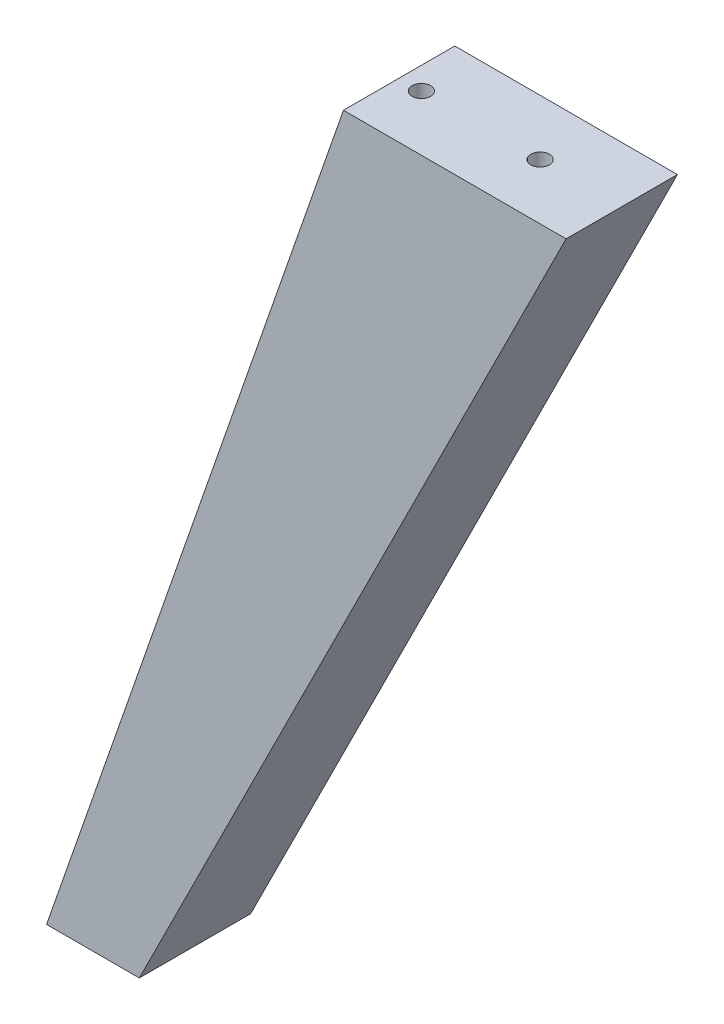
ISO-10303-21;
HEADER;
FILE_DESCRIPTION(('STEP AP214'),'2;1');
FILE_NAME('part.step','',(''),(''),'','','');
FILE_SCHEMA(('AUTOMOTIVE_DESIGN { 1 0 10303 214 1 1 1 1 }'));
ENDSEC;
DATA;
#1=APPLICATION_CONTEXT('core data for automotive mechanical design processes');
#2=APPLICATION_PROTOCOL_DEFINITION('international standard','automotive_design',2000,#1);
#3=PRODUCT_CONTEXT('',#1,'mechanical');
#4=PRODUCT('Part','Part','',(#3));
#5=PRODUCT_RELATED_PRODUCT_CATEGORY('part','',(#4));
#6=PRODUCT_DEFINITION_FORMATION('','',#4);
#7=PRODUCT_DEFINITION_CONTEXT('part definition',#1,'design');
#8=PRODUCT_DEFINITION('design','',#6,#7);
#9=PRODUCT_DEFINITION_SHAPE('','',#8);
#10=(LENGTH_UNIT() NAMED_UNIT(*) SI_UNIT(.MILLI.,.METRE.));
#11=(NAMED_UNIT(*) PLANE_ANGLE_UNIT() SI_UNIT($,.RADIAN.));
#12=(NAMED_UNIT(*) SI_UNIT($,.STERADIAN.) SOLID_ANGLE_UNIT());
#13=UNCERTAINTY_MEASURE_WITH_UNIT(LENGTH_MEASURE(1.E-05),#10,'distance_accuracy_value','');
#14=(GEOMETRIC_REPRESENTATION_CONTEXT(3) GLOBAL_UNCERTAINTY_ASSIGNED_CONTEXT((#13)) GLOBAL_UNIT_ASSIGNED_CONTEXT((#10,
#11,#12)) REPRESENTATION_CONTEXT('',''));
#15=CARTESIAN_POINT('',(0.,0.,0.));
#16=DIRECTION('',(0.,0.,1.));
#17=DIRECTION('',(1.,0.,0.));
#18=AXIS2_PLACEMENT_3D('',#15,#16,#17);
#19=CARTESIAN_POINT('',(140.,230.,15.));
#20=DIRECTION('',(-0.894427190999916,0.447213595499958,0.));
#21=DIRECTION('',(-0.447213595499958,-0.894427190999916,0.));
#22=AXIS2_PLACEMENT_3D('',#19,#20,#21);
#23=PLANE('',#22);
#24=DIRECTION('',(0.447213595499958,0.894427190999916,0.));
#25=VECTOR('',#24,1.);
#26=CARTESIAN_POINT('',(140.,230.,-15.));
#27=LINE('',#26,#25);
#28=CARTESIAN_POINT('',(25.,0.,-15.));
#29=VERTEX_POINT('',#28);
#30=CARTESIAN_POINT('',(140.,230.,-15.));
#31=VERTEX_POINT('',#30);
#32=EDGE_CURVE('E95',#29,#31,#27,.T.);
#33=ORIENTED_EDGE('',*,*,#32,.T.);
#34=DIRECTION('',(0.,0.,-1.));
#35=VECTOR('',#34,1.);
#36=CARTESIAN_POINT('',(140.,230.,15.));
#37=LINE('',#36,#35);
#38=CARTESIAN_POINT('',(140.,230.,15.));
#39=VERTEX_POINT('',#38);
#40=EDGE_CURVE('E11',#39,#31,#37,.T.);
#41=ORIENTED_EDGE('',*,*,#40,.F.);
#42=DIRECTION('',(0.447213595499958,0.894427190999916,0.));
#43=VECTOR('',#42,1.);
#44=CARTESIAN_POINT('',(140.,230.,15.));
#45=LINE('',#44,#43);
#46=CARTESIAN_POINT('',(25.,0.,15.));
#47=VERTEX_POINT('',#46);
#48=EDGE_CURVE('E83',#47,#39,#45,.T.);
#49=ORIENTED_EDGE('',*,*,#48,.F.);
#50=DIRECTION('',(0.,0.,-1.));
#51=VECTOR('',#50,1.);
#52=CARTESIAN_POINT('',(25.,0.,15.));
#53=LINE('',#52,#51);
#54=EDGE_CURVE('E91',#47,#29,#53,.T.);
#55=ORIENTED_EDGE('',*,*,#54,.T.);
#56=EDGE_LOOP('',(#33,#41,#49,#55));
#57=FACE_BOUND('',#56,.T.);
#58=ADVANCED_FACE('F32',(#57),#23,.F.);
#59=CARTESIAN_POINT('',(80.,230.,15.));
#60=DIRECTION('',(0.,-1.,0.));
#61=DIRECTION('',(0.,0.,-1.));
#62=AXIS2_PLACEMENT_3D('',#59,#60,#61);
#63=PLANE('',#62);
#64=CARTESIAN_POINT('',(118.,230.,0.));
#65=DIRECTION('',(0.,1.,0.));
#66=DIRECTION('',(0.,0.,1.));
#67=AXIS2_PLACEMENT_3D('',#64,#65,#66);
#68=CIRCLE('',#67,2.5);
#69=CARTESIAN_POINT('',(118.,230.,2.5));
#70=VERTEX_POINT('',#69);
#71=EDGE_CURVE('E115',#70,#70,#68,.T.);
#72=ORIENTED_EDGE('',*,*,#71,.F.);
#73=EDGE_LOOP('',(#72));
#74=FACE_BOUND('',#73,.T.);
#75=CARTESIAN_POINT('',(86.,230.,0.));
#76=DIRECTION('',(0.,1.,0.));
#77=DIRECTION('',(0.,0.,1.));
#78=AXIS2_PLACEMENT_3D('',#75,#76,#77);
#79=CIRCLE('',#78,2.5);
#80=CARTESIAN_POINT('',(86.,230.,2.5));
#81=VERTEX_POINT('',#80);
#82=EDGE_CURVE('E109',#81,#81,#79,.T.);
#83=ORIENTED_EDGE('',*,*,#82,.F.);
#84=EDGE_LOOP('',(#83));
#85=FACE_BOUND('',#84,.T.);
#86=DIRECTION('',(-1.,0.,0.));
#87=VECTOR('',#86,1.);
#88=CARTESIAN_POINT('',(80.,230.,-15.));
#89=LINE('',#88,#87);
#90=CARTESIAN_POINT('',(80.,230.,-15.));
#91=VERTEX_POINT('',#90);
#92=EDGE_CURVE('E87',#31,#91,#89,.T.);
#93=ORIENTED_EDGE('',*,*,#92,.T.);
#94=DIRECTION('',(0.,0.,-1.));
#95=VECTOR('',#94,1.);
#96=CARTESIAN_POINT('',(80.,230.,15.));
#97=LINE('',#96,#95);
#98=CARTESIAN_POINT('',(80.,230.,15.));
#99=VERTEX_POINT('',#98);
#100=EDGE_CURVE('E40',#99,#91,#97,.T.);
#101=ORIENTED_EDGE('',*,*,#100,.F.);
#102=DIRECTION('',(-1.,0.,0.));
#103=VECTOR('',#102,1.);
#104=CARTESIAN_POINT('',(80.,230.,15.));
#105=LINE('',#104,#103);
#106=EDGE_CURVE('E78',#39,#99,#105,.T.);
#107=ORIENTED_EDGE('',*,*,#106,.F.);
#108=ORIENTED_EDGE('',*,*,#40,.T.);
#109=EDGE_LOOP('',(#93,#101,#107,#108));
#110=FACE_BOUND('',#109,.T.);
#111=ADVANCED_FACE('F86',(#74,#85,#110),#63,.F.);
#112=CARTESIAN_POINT('',(0.,0.,15.));
#113=DIRECTION('',(0.944496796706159,-0.328520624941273,0.));
#114=DIRECTION('',(0.328520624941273,0.944496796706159,0.));
#115=AXIS2_PLACEMENT_3D('',#112,#113,#114);
#116=PLANE('',#115);
#117=DIRECTION('',(-0.328520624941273,-0.944496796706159,0.));
#118=VECTOR('',#117,1.);
#119=CARTESIAN_POINT('',(0.,0.,-15.));
#120=LINE('',#119,#118);
#121=CARTESIAN_POINT('',(0.,0.,-15.));
#122=VERTEX_POINT('',#121);
#123=EDGE_CURVE('E65',#91,#122,#120,.T.);
#124=ORIENTED_EDGE('',*,*,#123,.T.);
#125=DIRECTION('',(0.,0.,-1.));
#126=VECTOR('',#125,1.);
#127=CARTESIAN_POINT('',(0.,0.,15.));
#128=LINE('',#127,#126);
#129=CARTESIAN_POINT('',(0.,0.,15.));
#130=VERTEX_POINT('',#129);
#131=EDGE_CURVE('E88',#130,#122,#128,.T.);
#132=ORIENTED_EDGE('',*,*,#131,.F.);
#133=DIRECTION('',(-0.328520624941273,-0.944496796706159,0.));
#134=VECTOR('',#133,1.);
#135=CARTESIAN_POINT('',(0.,0.,15.));
#136=LINE('',#135,#134);
#137=EDGE_CURVE('E81',#99,#130,#136,.T.);
#138=ORIENTED_EDGE('',*,*,#137,.F.);
#139=ORIENTED_EDGE('',*,*,#100,.T.);
#140=EDGE_LOOP('',(#124,#132,#138,#139));
#141=FACE_BOUND('',#140,.T.);
#142=ADVANCED_FACE('F89',(#141),#116,.F.);
#143=CARTESIAN_POINT('',(25.,0.,15.));
#144=DIRECTION('',(0.,1.,0.));
#145=DIRECTION('',(0.,0.,1.));
#146=AXIS2_PLACEMENT_3D('',#143,#144,#145);
#147=PLANE('',#146);
#148=DIRECTION('',(1.,0.,0.));
#149=VECTOR('',#148,1.);
#150=CARTESIAN_POINT('',(25.,0.,-15.));
#151=LINE('',#150,#149);
#152=EDGE_CURVE('E71',#122,#29,#151,.T.);
#153=ORIENTED_EDGE('',*,*,#152,.T.);
#154=ORIENTED_EDGE('',*,*,#54,.F.);
#155=DIRECTION('',(1.,0.,0.));
#156=VECTOR('',#155,1.);
#157=CARTESIAN_POINT('',(25.,0.,15.));
#158=LINE('',#157,#156);
#159=EDGE_CURVE('E48',#130,#47,#158,.T.);
#160=ORIENTED_EDGE('',*,*,#159,.F.);
#161=ORIENTED_EDGE('',*,*,#131,.T.);
#162=EDGE_LOOP('',(#153,#154,#160,#161));
#163=FACE_BOUND('',#162,.T.);
#164=ADVANCED_FACE('F103',(#163),#147,.F.);
#165=CARTESIAN_POINT('',(0.,0.,15.));
#166=DIRECTION('',(0.,0.,-1.));
#167=DIRECTION('',(-1.,0.,0.));
#168=AXIS2_PLACEMENT_3D('',#165,#166,#167);
#169=PLANE('',#168);
#170=ORIENTED_EDGE('',*,*,#48,.T.);
#171=ORIENTED_EDGE('',*,*,#106,.T.);
#172=ORIENTED_EDGE('',*,*,#137,.T.);
#173=ORIENTED_EDGE('',*,*,#159,.T.);
#174=EDGE_LOOP('',(#170,#171,#172,#173));
#175=FACE_BOUND('',#174,.T.);
#176=ADVANCED_FACE('F79',(#175),#169,.F.);
#177=CARTESIAN_POINT('',(0.,0.,-15.));
#178=DIRECTION('',(0.,0.,-1.));
#179=DIRECTION('',(-1.,0.,0.));
#180=AXIS2_PLACEMENT_3D('',#177,#178,#179);
#181=PLANE('',#180);
#182=ORIENTED_EDGE('',*,*,#32,.F.);
#183=ORIENTED_EDGE('',*,*,#152,.F.);
#184=ORIENTED_EDGE('',*,*,#123,.F.);
#185=ORIENTED_EDGE('',*,*,#92,.F.);
#186=EDGE_LOOP('',(#182,#183,#184,#185));
#187=FACE_BOUND('',#186,.T.);
#188=ADVANCED_FACE('F106',(#187),#181,.T.);
#189=CARTESIAN_POINT('',(86.,205.,0.));
#190=DIRECTION('',(0.,1.,0.));
#191=DIRECTION('',(0.,0.,1.));
#192=AXIS2_PLACEMENT_3D('',#189,#190,#191);
#193=CYLINDRICAL_SURFACE('',#192,2.5);
#194=CARTESIAN_POINT('',(86.,205.,0.));
#195=DIRECTION('',(0.,1.,0.));
#196=DIRECTION('',(0.,0.,1.));
#197=AXIS2_PLACEMENT_3D('',#194,#195,#196);
#198=CIRCLE('',#197,2.5);
#199=CARTESIAN_POINT('',(86.,205.,2.5));
#200=VERTEX_POINT('',#199);
#201=EDGE_CURVE('E112',#200,#200,#198,.T.);
#202=ORIENTED_EDGE('',*,*,#201,.F.);
#203=EDGE_LOOP('',(#202));
#204=FACE_BOUND('',#203,.T.);
#205=ORIENTED_EDGE('',*,*,#82,.T.);
#206=EDGE_LOOP('',(#205));
#207=FACE_BOUND('',#206,.T.);
#208=ADVANCED_FACE('F134',(#204,#207),#193,.F.);
#209=CARTESIAN_POINT('',(86.,205.,0.));
#210=DIRECTION('',(0.,1.,0.));
#211=DIRECTION('',(0.,0.,1.));
#212=AXIS2_PLACEMENT_3D('',#209,#210,#211);
#213=PLANE('',#212);
#214=ORIENTED_EDGE('',*,*,#201,.T.);
#215=EDGE_LOOP('',(#214));
#216=FACE_BOUND('',#215,.T.);
#217=ADVANCED_FACE('F126',(#216),#213,.T.);
#218=CARTESIAN_POINT('',(118.,205.,0.));
#219=DIRECTION('',(0.,1.,0.));
#220=DIRECTION('',(0.,0.,1.));
#221=AXIS2_PLACEMENT_3D('',#218,#219,#220);
#222=CYLINDRICAL_SURFACE('',#221,2.5);
#223=CARTESIAN_POINT('',(118.,205.,0.));
#224=DIRECTION('',(0.,1.,0.));
#225=DIRECTION('',(0.,0.,1.));
#226=AXIS2_PLACEMENT_3D('',#223,#224,#225);
#227=CIRCLE('',#226,2.5);
#228=CARTESIAN_POINT('',(118.,205.,2.5));
#229=VERTEX_POINT('',#228);
#230=EDGE_CURVE('E98',#229,#229,#227,.T.);
#231=ORIENTED_EDGE('',*,*,#230,.F.);
#232=EDGE_LOOP('',(#231));
#233=FACE_BOUND('',#232,.T.);
#234=ORIENTED_EDGE('',*,*,#71,.T.);
#235=EDGE_LOOP('',(#234));
#236=FACE_BOUND('',#235,.T.);
#237=ADVANCED_FACE('F123',(#233,#236),#222,.F.);
#238=CARTESIAN_POINT('',(118.,205.,0.));
#239=DIRECTION('',(0.,1.,0.));
#240=DIRECTION('',(0.,0.,1.));
#241=AXIS2_PLACEMENT_3D('',#238,#239,#240);
#242=PLANE('',#241);
#243=ORIENTED_EDGE('',*,*,#230,.T.);
#244=EDGE_LOOP('',(#243));
#245=FACE_BOUND('',#244,.T.);
#246=ADVANCED_FACE('F121',(#245),#242,.T.);
#247=CLOSED_SHELL('',(#58,#111,#142,#164,#176,#188,#208,#217,#237,#246));
#248=MANIFOLD_SOLID_BREP('B2',#247);
#249=ADVANCED_BREP_SHAPE_REPRESENTATION('',(#18,#248),#14);
#250=SHAPE_DEFINITION_REPRESENTATION(#9,#249);
ENDSEC;
END-ISO-10303-21;
